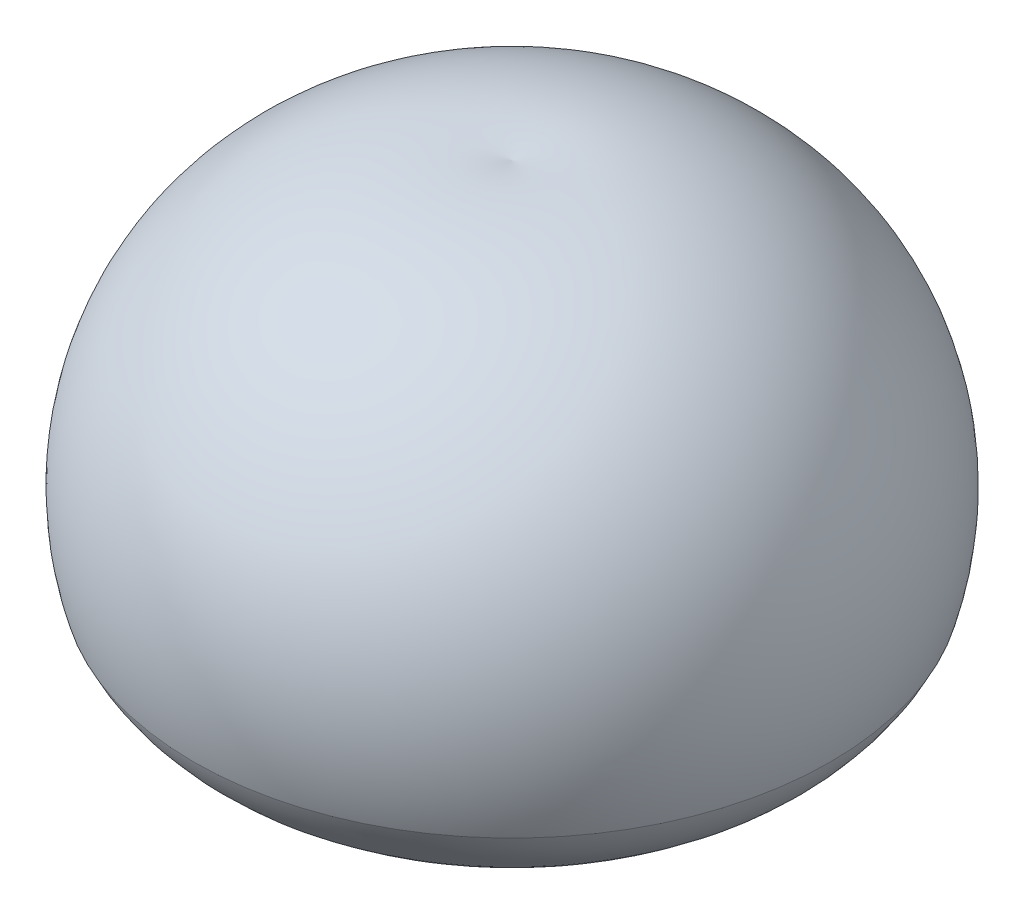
ISO-10303-21;
HEADER;
FILE_DESCRIPTION(('STEP AP214'),'2;1');
FILE_NAME('part.step','',(''),(''),'','','');
FILE_SCHEMA(('AUTOMOTIVE_DESIGN { 1 0 10303 214 1 1 1 1 }'));
ENDSEC;
DATA;
#1=APPLICATION_CONTEXT('core data for automotive mechanical design processes');
#2=APPLICATION_PROTOCOL_DEFINITION('international standard','automotive_design',2000,#1);
#3=PRODUCT_CONTEXT('',#1,'mechanical');
#4=PRODUCT('Part','Part','',(#3));
#5=PRODUCT_RELATED_PRODUCT_CATEGORY('part','',(#4));
#6=PRODUCT_DEFINITION_FORMATION('','',#4);
#7=PRODUCT_DEFINITION_CONTEXT('part definition',#1,'design');
#8=PRODUCT_DEFINITION('design','',#6,#7);
#9=PRODUCT_DEFINITION_SHAPE('','',#8);
#10=(LENGTH_UNIT() NAMED_UNIT(*) SI_UNIT(.MILLI.,.METRE.));
#11=(NAMED_UNIT(*) PLANE_ANGLE_UNIT() SI_UNIT($,.RADIAN.));
#12=(NAMED_UNIT(*) SI_UNIT($,.STERADIAN.) SOLID_ANGLE_UNIT());
#13=UNCERTAINTY_MEASURE_WITH_UNIT(LENGTH_MEASURE(1.E-05),#10,'distance_accuracy_value','');
#14=(GEOMETRIC_REPRESENTATION_CONTEXT(3) GLOBAL_UNCERTAINTY_ASSIGNED_CONTEXT((#13)) GLOBAL_UNIT_ASSIGNED_CONTEXT((#10,
#11,#12)) REPRESENTATION_CONTEXT('',''));
#15=CARTESIAN_POINT('',(0.,0.,0.));
#16=DIRECTION('',(0.,0.,1.));
#17=DIRECTION('',(1.,0.,0.));
#18=AXIS2_PLACEMENT_3D('',#15,#16,#17);
#19=CARTESIAN_POINT('',(0.,830.,-400.));
#20=DIRECTION('',(-1.,0.,0.));
#21=DIRECTION('',(0.,0.,-1.));
#22=AXIS2_PLACEMENT_3D('',#19,#20,#21);
#23=CIRCLE('',#22,2600.15030434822);
#24=TRIMMED_CURVE('',#23,(PARAMETER_VALUE(-1.72524692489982)),
(PARAMETER_VALUE(1.72524692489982)),.T.,.PARAMETER.);
#25=CARTESIAN_POINT('',(0.,830.,0.));
#26=DIRECTION('',(0.,-1.,0.));
#27=AXIS1_PLACEMENT('',#25,#26);
#28=SURFACE_OF_REVOLUTION('',#24,#27);
#29=CARTESIAN_POINT('',(0.,104.135639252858,0.));
#30=DIRECTION('',(0.,-1.,0.));
#31=DIRECTION('',(0.,0.,-1.));
#32=AXIS2_PLACEMENT_3D('',#29,#30,#31);
#33=CIRCLE('',#32,2896.77843129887);
#34=CARTESIAN_POINT('',(0.,104.135639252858,-2896.77843129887));
#35=VERTEX_POINT('',#34);
#36=EDGE_CURVE('E10',#35,#35,#33,.T.);
#37=ORIENTED_EDGE('',*,*,#36,.F.);
#38=EDGE_LOOP('',(#37));
#39=FACE_BOUND('',#38,.T.);
#40=CARTESIAN_POINT('',(0.,3399.19863093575,0.));
#41=VERTEX_POINT('',#40);
#42=VERTEX_LOOP('',#41);
#43=FACE_BOUND('',#42,.T.);
#44=ADVANCED_FACE('F16',(#39,#43),#28,.T.);
#45=CARTESIAN_POINT('',(0.,727.592002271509,0.));
#46=DIRECTION('',(0.,-1.,0.));
#47=DIRECTION('',(0.,0.,-1.));
#48=AXIS2_PLACEMENT_3D('',#45,#46,#47);
#49=TOROIDAL_SURFACE('',#48,1570.5287702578,1465.48149084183);
#50=CARTESIAN_POINT('',(0.,-392.104416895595,0.));
#51=DIRECTION('',(0.,-1.,0.));
#52=DIRECTION('',(0.,0.,-1.));
#53=AXIS2_PLACEMENT_3D('',#50,#51,#52);
#54=CIRCLE('',#53,625.057496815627);
#55=CARTESIAN_POINT('',(0.,-392.104416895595,-625.057496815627));
#56=VERTEX_POINT('',#55);
#57=EDGE_CURVE('E23',#56,#56,#54,.T.);
#58=ORIENTED_EDGE('',*,*,#57,.F.);
#59=EDGE_LOOP('',(#58));
#60=FACE_BOUND('',#59,.T.);
#61=ORIENTED_EDGE('',*,*,#36,.T.);
#62=EDGE_LOOP('',(#61));
#63=FACE_BOUND('',#62,.T.);
#64=ADVANCED_FACE('F47',(#60,#63),#49,.T.);
#65=CARTESIAN_POINT('',(0.,0.,0.));
#66=DIRECTION('',(0.,-1.,0.));
#67=DIRECTION('',(0.,0.,-1.));
#68=AXIS2_PLACEMENT_3D('',#65,#66,#67);
#69=CYLINDRICAL_SURFACE('',#68,625.057496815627);
#70=CARTESIAN_POINT('',(0.,151.502631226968,0.));
#71=DIRECTION('',(0.,-1.,0.));
#72=DIRECTION('',(0.,0.,-1.));
#73=AXIS2_PLACEMENT_3D('',#70,#71,#72);
#74=CIRCLE('',#73,625.057496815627);
#75=CARTESIAN_POINT('',(0.,151.502631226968,-625.057496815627));
#76=VERTEX_POINT('',#75);
#77=EDGE_CURVE('E38',#76,#76,#74,.T.);
#78=ORIENTED_EDGE('',*,*,#77,.F.);
#79=EDGE_LOOP('',(#78));
#80=FACE_BOUND('',#79,.T.);
#81=ORIENTED_EDGE('',*,*,#57,.T.);
#82=EDGE_LOOP('',(#81));
#83=FACE_BOUND('',#82,.T.);
#84=ADVANCED_FACE('F45',(#80,#83),#69,.F.);
#85=CARTESIAN_POINT('',(0.,830.,0.));
#86=DIRECTION('',(0.,-1.,0.));
#87=DIRECTION('',(0.,0.,-1.));
#88=AXIS2_PLACEMENT_3D('',#85,#86,#87);
#89=DEGENERATE_TOROIDAL_SURFACE('',#88,400.,714.849324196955,.T.);
#90=CARTESIAN_POINT('',(0.,1484.23173864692,0.));
#91=DIRECTION('',(0.,-1.,0.));
#92=DIRECTION('',(0.,0.,-1.));
#93=AXIS2_PLACEMENT_3D('',#90,#91,#92);
#94=CIRCLE('',#93,688.080524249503);
#95=CARTESIAN_POINT('',(0.,1484.23173864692,-688.080524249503));
#96=VERTEX_POINT('',#95);
#97=EDGE_CURVE('E36',#96,#96,#94,.T.);
#98=ORIENTED_EDGE('',*,*,#97,.F.);
#99=EDGE_LOOP('',(#98));
#100=FACE_BOUND('',#99,.T.);
#101=ORIENTED_EDGE('',*,*,#77,.T.);
#102=EDGE_LOOP('',(#101));
#103=FACE_BOUND('',#102,.T.);
#104=ADVANCED_FACE('F32',(#100,#103),#89,.F.);
#105=CARTESIAN_POINT('',(0.,1134.11237799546,734.962845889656));
#106=DIRECTION('',(-1.,0.,0.));
#107=DIRECTION('',(0.,0.,-1.));
#108=AXIS2_PLACEMENT_3D('',#105,#106,#107);
#109=CIRCLE('',#108,1465.48149084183);
#110=TRIMMED_CURVE('',#109,(PARAMETER_VALUE(-1.0454457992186)),
(PARAMETER_VALUE(1.0454457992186)),.T.,.PARAMETER.);
#111=CARTESIAN_POINT('',(0.,1134.11237799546,0.));
#112=DIRECTION('',(0.,-1.,0.));
#113=AXIS1_PLACEMENT('',#111,#112);
#114=SURFACE_OF_REVOLUTION('',#110,#113);
#115=CARTESIAN_POINT('',(0.,2401.97105117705,0.));
#116=VERTEX_POINT('',#115);
#117=VERTEX_LOOP('',#116);
#118=FACE_BOUND('',#117,.T.);
#119=ORIENTED_EDGE('',*,*,#97,.T.);
#120=EDGE_LOOP('',(#119));
#121=FACE_BOUND('',#120,.T.);
#122=ADVANCED_FACE('F29',(#118,#121),#114,.F.);
#123=CLOSED_SHELL('',(#44,#64,#84,#104,#122));
#124=MANIFOLD_SOLID_BREP('B1',#123);
#125=ADVANCED_BREP_SHAPE_REPRESENTATION('',(#18,#124),#14);
#126=SHAPE_DEFINITION_REPRESENTATION(#9,#125);
ENDSEC;
END-ISO-10303-21;
